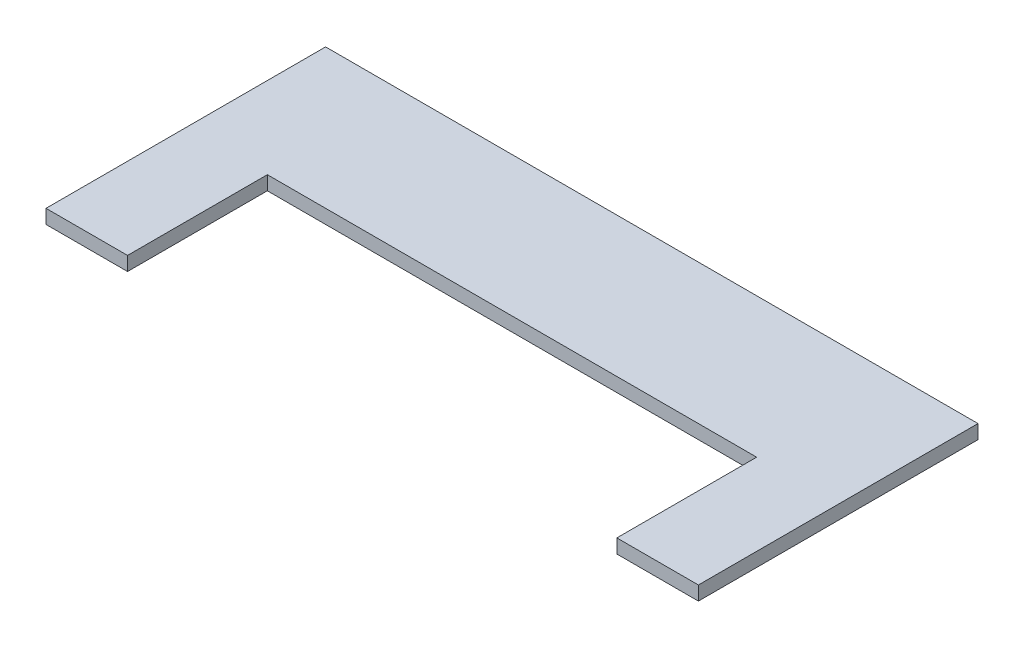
from build123d import *

# Parameters (mm, degrees)
BOSS_EXTRUDE1_DEPTH = 6


with BuildPart() as part:
    # Sketch1 → Boss-Extrude1 (new body)
    with BuildSketch(Plane(origin=(0, 0, 0), x_dir=(1, 0, 0), z_dir=(0, 1, 0))):
        Polygon((0, 0), (0, 120), (280, 120), (280, 0), (245, 0), (245, 60), (35, 60), (35, 0), align=None)
    extrude(amount=BOSS_EXTRUDE1_DEPTH)


solid = part.part
